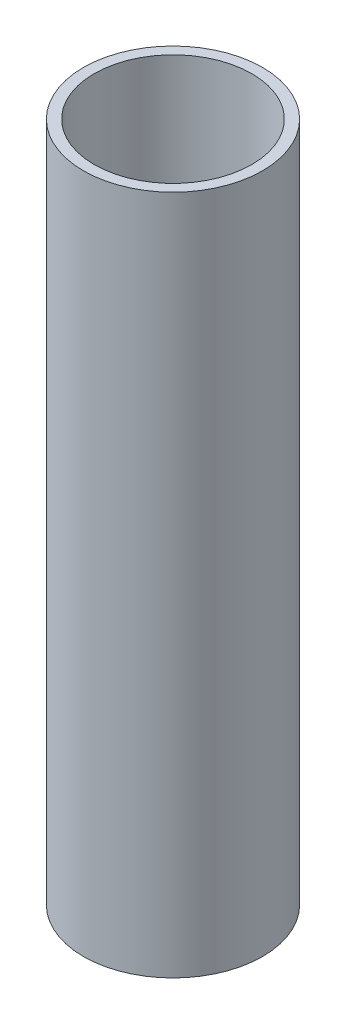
from build123d import *

# Parameters (mm, degrees)
SKETCH_1_R      = 25
SKETCH_1_R_2    = 22
EXTRUDE_1_DEPTH = 190


with BuildPart() as part:
    # Sketch 1 → Extrude 1 (new body)
    with BuildSketch(Plane(origin=(0, 0, 0), x_dir=(1, 0, 0), z_dir=(0, 1, 0))):
        with Locations(Location((0, 0, 0), (0, 0, 270))):
            Circle(SKETCH_1_R)
        with Locations(Location((0, 0, 0), (0, 0, 270))):
            Circle(SKETCH_1_R_2, mode=Mode.SUBTRACT)
    extrude(amount=EXTRUDE_1_DEPTH)


solid = part.part
